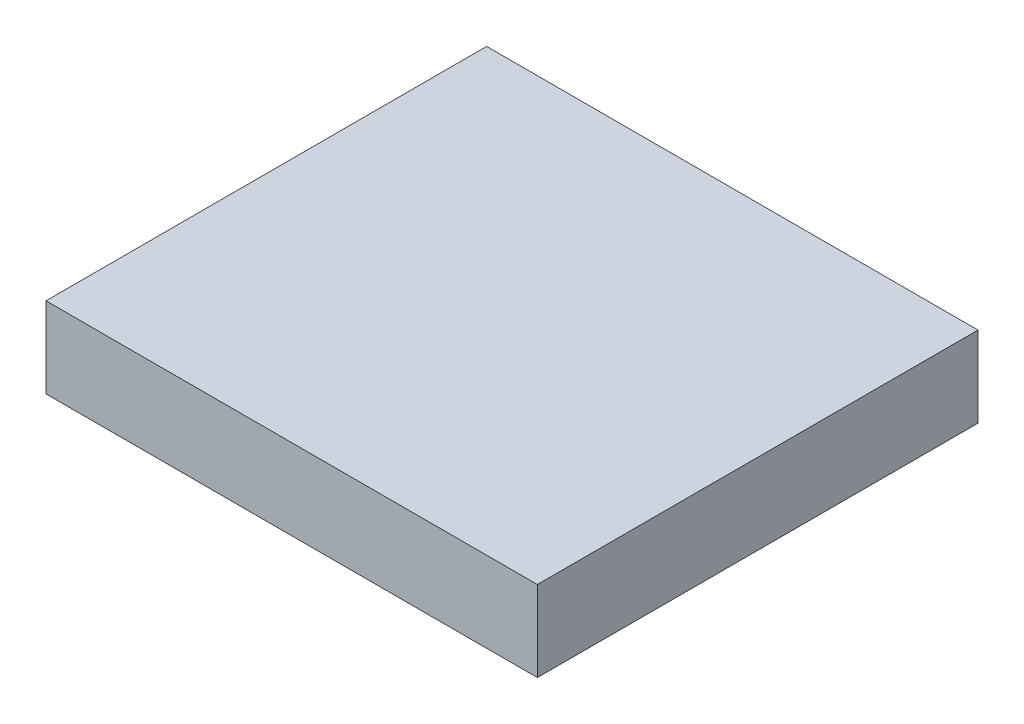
ISO-10303-21;
HEADER;
FILE_DESCRIPTION(('STEP AP214'),'2;1');
FILE_NAME('part.step','',(''),(''),'','','');
FILE_SCHEMA(('AUTOMOTIVE_DESIGN { 1 0 10303 214 1 1 1 1 }'));
ENDSEC;
DATA;
#1=APPLICATION_CONTEXT('core data for automotive mechanical design processes');
#2=APPLICATION_PROTOCOL_DEFINITION('international standard','automotive_design',2000,#1);
#3=PRODUCT_CONTEXT('',#1,'mechanical');
#4=PRODUCT('Part','Part','',(#3));
#5=PRODUCT_RELATED_PRODUCT_CATEGORY('part','',(#4));
#6=PRODUCT_DEFINITION_FORMATION('','',#4);
#7=PRODUCT_DEFINITION_CONTEXT('part definition',#1,'design');
#8=PRODUCT_DEFINITION('design','',#6,#7);
#9=PRODUCT_DEFINITION_SHAPE('','',#8);
#10=(LENGTH_UNIT() NAMED_UNIT(*) SI_UNIT(.MILLI.,.METRE.));
#11=(NAMED_UNIT(*) PLANE_ANGLE_UNIT() SI_UNIT($,.RADIAN.));
#12=(NAMED_UNIT(*) SI_UNIT($,.STERADIAN.) SOLID_ANGLE_UNIT());
#13=UNCERTAINTY_MEASURE_WITH_UNIT(LENGTH_MEASURE(1.E-05),#10,'distance_accuracy_value','');
#14=(GEOMETRIC_REPRESENTATION_CONTEXT(3) GLOBAL_UNCERTAINTY_ASSIGNED_CONTEXT((#13)) GLOBAL_UNIT_ASSIGNED_CONTEXT((#10,
#11,#12)) REPRESENTATION_CONTEXT('',''));
#15=CARTESIAN_POINT('',(0.,0.,0.));
#16=DIRECTION('',(0.,0.,1.));
#17=DIRECTION('',(1.,0.,0.));
#18=AXIS2_PLACEMENT_3D('',#15,#16,#17);
#19=CARTESIAN_POINT('',(0.,0.,203.2));
#20=DIRECTION('',(1.,0.,0.));
#21=DIRECTION('',(0.,0.,-1.));
#22=AXIS2_PLACEMENT_3D('',#19,#20,#21);
#23=PLANE('',#22);
#24=DIRECTION('',(0.,-1.,0.));
#25=VECTOR('',#24,1.);
#26=CARTESIAN_POINT('',(0.,0.,0.));
#27=LINE('',#26,#25);
#28=CARTESIAN_POINT('',(0.,37.1788922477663,0.));
#29=VERTEX_POINT('',#28);
#30=CARTESIAN_POINT('',(0.,0.,0.));
#31=VERTEX_POINT('',#30);
#32=EDGE_CURVE('E73',#29,#31,#27,.T.);
#33=ORIENTED_EDGE('',*,*,#32,.T.);
#34=DIRECTION('',(0.,0.,-1.));
#35=VECTOR('',#34,1.);
#36=CARTESIAN_POINT('',(0.,0.,203.2));
#37=LINE('',#36,#35);
#38=CARTESIAN_POINT('',(0.,0.,203.2));
#39=VERTEX_POINT('',#38);
#40=EDGE_CURVE('E11',#39,#31,#37,.T.);
#41=ORIENTED_EDGE('',*,*,#40,.F.);
#42=DIRECTION('',(0.,-1.,0.));
#43=VECTOR('',#42,1.);
#44=CARTESIAN_POINT('',(0.,0.,203.2));
#45=LINE('',#44,#43);
#46=CARTESIAN_POINT('',(0.,37.1788922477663,203.2));
#47=VERTEX_POINT('',#46);
#48=EDGE_CURVE('E91',#47,#39,#45,.T.);
#49=ORIENTED_EDGE('',*,*,#48,.F.);
#50=DIRECTION('',(0.,0.,-1.));
#51=VECTOR('',#50,1.);
#52=CARTESIAN_POINT('',(0.,37.1788922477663,203.2));
#53=LINE('',#52,#51);
#54=EDGE_CURVE('E85',#47,#29,#53,.T.);
#55=ORIENTED_EDGE('',*,*,#54,.T.);
#56=EDGE_LOOP('',(#33,#41,#49,#55));
#57=FACE_BOUND('',#56,.T.);
#58=ADVANCED_FACE('F29',(#57),#23,.F.);
#59=CARTESIAN_POINT('',(0.,0.,203.2));
#60=DIRECTION('',(0.,1.,0.));
#61=DIRECTION('',(0.,0.,1.));
#62=AXIS2_PLACEMENT_3D('',#59,#60,#61);
#63=PLANE('',#62);
#64=DIRECTION('',(1.,0.,0.));
#65=VECTOR('',#64,1.);
#66=CARTESIAN_POINT('',(0.,0.,0.));
#67=LINE('',#66,#65);
#68=CARTESIAN_POINT('',(226.589879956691,0.,0.));
#69=VERTEX_POINT('',#68);
#70=EDGE_CURVE('E69',#31,#69,#67,.T.);
#71=ORIENTED_EDGE('',*,*,#70,.T.);
#72=DIRECTION('',(0.,0.,-1.));
#73=VECTOR('',#72,1.);
#74=CARTESIAN_POINT('',(226.589879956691,0.,203.2));
#75=LINE('',#74,#73);
#76=CARTESIAN_POINT('',(226.589879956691,0.,203.2));
#77=VERTEX_POINT('',#76);
#78=EDGE_CURVE('E36',#77,#69,#75,.T.);
#79=ORIENTED_EDGE('',*,*,#78,.F.);
#80=DIRECTION('',(1.,0.,0.));
#81=VECTOR('',#80,1.);
#82=CARTESIAN_POINT('',(0.,0.,203.2));
#83=LINE('',#82,#81);
#84=EDGE_CURVE('E81',#39,#77,#83,.T.);
#85=ORIENTED_EDGE('',*,*,#84,.F.);
#86=ORIENTED_EDGE('',*,*,#40,.T.);
#87=EDGE_LOOP('',(#71,#79,#85,#86));
#88=FACE_BOUND('',#87,.T.);
#89=ADVANCED_FACE('F80',(#88),#63,.F.);
#90=CARTESIAN_POINT('',(226.589879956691,0.,203.2));
#91=DIRECTION('',(-1.,0.,0.));
#92=DIRECTION('',(0.,0.,1.));
#93=AXIS2_PLACEMENT_3D('',#90,#91,#92);
#94=PLANE('',#93);
#95=DIRECTION('',(0.,1.,0.));
#96=VECTOR('',#95,1.);
#97=CARTESIAN_POINT('',(226.589879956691,0.,0.));
#98=LINE('',#97,#96);
#99=CARTESIAN_POINT('',(226.589879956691,37.1788922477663,0.));
#100=VERTEX_POINT('',#99);
#101=EDGE_CURVE('E74',#69,#100,#98,.T.);
#102=ORIENTED_EDGE('',*,*,#101,.T.);
#103=DIRECTION('',(0.,0.,-1.));
#104=VECTOR('',#103,1.);
#105=CARTESIAN_POINT('',(226.589879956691,37.1788922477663,203.2));
#106=LINE('',#105,#104);
#107=CARTESIAN_POINT('',(226.589879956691,37.1788922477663,203.2));
#108=VERTEX_POINT('',#107);
#109=EDGE_CURVE('E97',#108,#100,#106,.T.);
#110=ORIENTED_EDGE('',*,*,#109,.F.);
#111=DIRECTION('',(0.,1.,0.));
#112=VECTOR('',#111,1.);
#113=CARTESIAN_POINT('',(226.589879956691,0.,203.2));
#114=LINE('',#113,#112);
#115=EDGE_CURVE('E48',#77,#108,#114,.T.);
#116=ORIENTED_EDGE('',*,*,#115,.F.);
#117=ORIENTED_EDGE('',*,*,#78,.T.);
#118=EDGE_LOOP('',(#102,#110,#116,#117));
#119=FACE_BOUND('',#118,.T.);
#120=ADVANCED_FACE('F100',(#119),#94,.F.);
#121=CARTESIAN_POINT('',(0.,37.1788922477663,203.2));
#122=DIRECTION('',(0.,-1.,0.));
#123=DIRECTION('',(0.,0.,-1.));
#124=AXIS2_PLACEMENT_3D('',#121,#122,#123);
#125=PLANE('',#124);
#126=DIRECTION('',(-1.,0.,0.));
#127=VECTOR('',#126,1.);
#128=CARTESIAN_POINT('',(0.,37.1788922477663,0.));
#129=LINE('',#128,#127);
#130=EDGE_CURVE('E89',#100,#29,#129,.T.);
#131=ORIENTED_EDGE('',*,*,#130,.T.);
#132=ORIENTED_EDGE('',*,*,#54,.F.);
#133=DIRECTION('',(-1.,0.,0.));
#134=VECTOR('',#133,1.);
#135=CARTESIAN_POINT('',(0.,37.1788922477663,203.2));
#136=LINE('',#135,#134);
#137=EDGE_CURVE('E43',#108,#47,#136,.T.);
#138=ORIENTED_EDGE('',*,*,#137,.F.);
#139=ORIENTED_EDGE('',*,*,#109,.T.);
#140=EDGE_LOOP('',(#131,#132,#138,#139));
#141=FACE_BOUND('',#140,.T.);
#142=ADVANCED_FACE('F102',(#141),#125,.F.);
#143=CARTESIAN_POINT('',(0.,37.1788922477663,203.2));
#144=DIRECTION('',(0.,0.,-1.));
#145=DIRECTION('',(-1.,0.,0.));
#146=AXIS2_PLACEMENT_3D('',#143,#144,#145);
#147=PLANE('',#146);
#148=ORIENTED_EDGE('',*,*,#48,.T.);
#149=ORIENTED_EDGE('',*,*,#84,.T.);
#150=ORIENTED_EDGE('',*,*,#115,.T.);
#151=ORIENTED_EDGE('',*,*,#137,.T.);
#152=EDGE_LOOP('',(#148,#149,#150,#151));
#153=FACE_BOUND('',#152,.T.);
#154=ADVANCED_FACE('F103',(#153),#147,.F.);
#155=CARTESIAN_POINT('',(0.,37.1788922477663,0.));
#156=DIRECTION('',(0.,0.,-1.));
#157=DIRECTION('',(-1.,0.,0.));
#158=AXIS2_PLACEMENT_3D('',#155,#156,#157);
#159=PLANE('',#158);
#160=ORIENTED_EDGE('',*,*,#32,.F.);
#161=ORIENTED_EDGE('',*,*,#130,.F.);
#162=ORIENTED_EDGE('',*,*,#101,.F.);
#163=ORIENTED_EDGE('',*,*,#70,.F.);
#164=EDGE_LOOP('',(#160,#161,#162,#163));
#165=FACE_BOUND('',#164,.T.);
#166=ADVANCED_FACE('F70',(#165),#159,.T.);
#167=CLOSED_SHELL('',(#58,#89,#120,#142,#154,#166));
#168=MANIFOLD_SOLID_BREP('B2',#167);
#169=ADVANCED_BREP_SHAPE_REPRESENTATION('',(#18,#168),#14);
#170=SHAPE_DEFINITION_REPRESENTATION(#9,#169);
ENDSEC;
END-ISO-10303-21;
